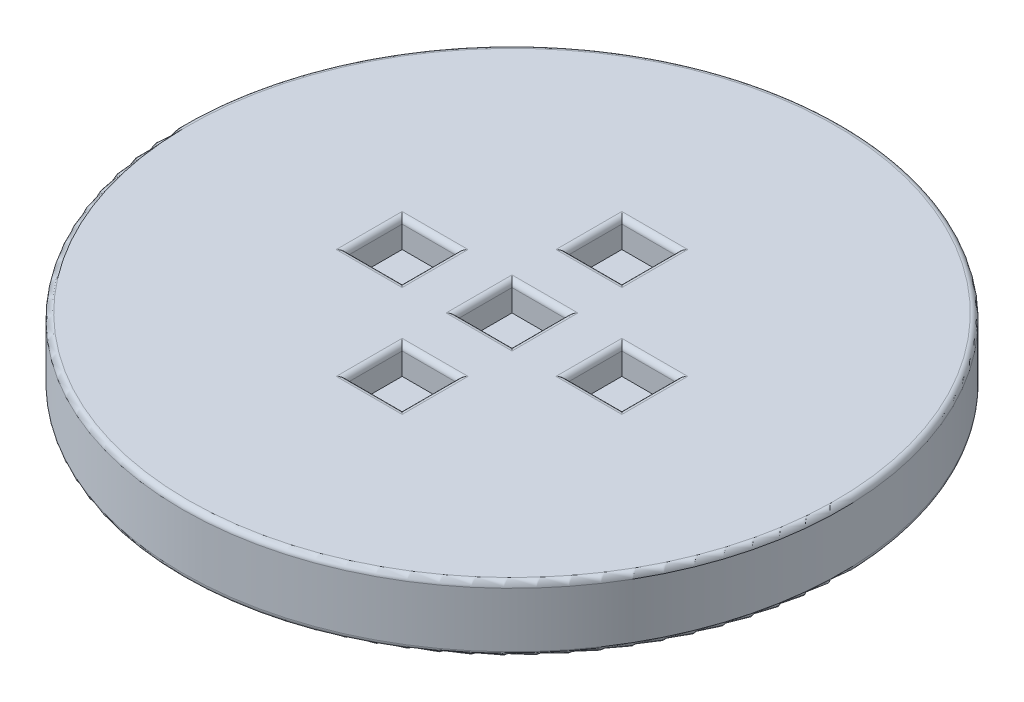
from build123d import *

# Parameters (mm, degrees)
SKETCH1_R           = 30
BOSS_EXTRUDE1_DEPTH = 6
SKETCH2_W           = 5
SKETCH2_H           = 5
CUT_EXTRUDE1_DEPTH  = 2.5
FILLET1_R           = 0.5
SKETCH4_W           = 5
SKETCH4_H           = 5
CUT_EXTRUDE2_DEPTH  = 2.5
FILLET2_R           = 0.5
FILLET3_R           = 0.5


with BuildPart() as part:
    # Sketch1 → Boss-Extrude1 (new body)
    with BuildSketch(Plane(origin=(0, 0, 0), x_dir=(1, 0, 0), z_dir=(0, 1, 0))):
        with Locations(Location((0, 0, 0), (0, 0, 270))):
            Circle(SKETCH1_R)
    extrude(amount=BOSS_EXTRUDE1_DEPTH)

    # Sketch2 → Cut-Extrude1 (cut)
    with BuildSketch(Plane(origin=(0, 6, 0), x_dir=(1, 0, 0), z_dir=(0, 1, 0))):
        with Locations((0, -10)):
            Rectangle(SKETCH2_W, SKETCH2_H)
        with Locations((-10, 0)):
            Rectangle(SKETCH2_W, SKETCH2_H)
        Rectangle(SKETCH2_W, SKETCH2_H)
        with Locations((0, 10)):
            Rectangle(SKETCH2_W, SKETCH2_H)
        with Locations((10, 0)):
            Rectangle(SKETCH2_W, SKETCH2_H)
    extrude(amount=-CUT_EXTRUDE1_DEPTH, mode=Mode.SUBTRACT)

    # Fillet1
    fillet1_edges = [part.edges().sort_by_distance(p)[0] for p in [
        (2.5, 6, 0),
        (0, 6, 2.5),
        (-12.5, 6, 0),
        (-10, 6, 2.5),
        (-7.5, 6, 0),
        (-10, 6, -2.5),
    ]]
    fillet(fillet1_edges, radius=FILLET1_R)

    # Sketch4 → Cut-Extrude2 (cut)
    with BuildSketch(Plane(origin=(0, 0, 0), x_dir=(-1, 0, 0), z_dir=(0, -1, 0))):
        Rectangle(SKETCH4_W, SKETCH4_H)
        with Locations((0, -10)):
            Rectangle(SKETCH4_W, SKETCH4_H)
        with Locations((10, 0)):
            Rectangle(SKETCH4_W, SKETCH4_H)
        with Locations((-10, 0)):
            Rectangle(SKETCH4_W, SKETCH4_H)
        with Locations((0, 10)):
            Rectangle(SKETCH4_W, SKETCH4_H)
    extrude(amount=-CUT_EXTRUDE2_DEPTH, mode=Mode.SUBTRACT)

    # Fillet2
    fillet2_edges = [part.edges().sort_by_distance(p)[0] for p in [
        (-2.5, 0, 0),
        (0, 0, -2.5),
        (2.5, 0, 0),
        (0, 0, 2.5),
        (-2.5, 0, 10),
        (0, 0, 7.5),
        (2.5, 0, 10),
        (0, 0, 12.5),
        (-12.5, 0, 0),
        (-10, 0, -2.5),
        (-7.5, 0, 0),
        (-10, 0, 2.5),
        (7.5, 0, 0),
        (10, 0, -2.5),
        (12.5, 0, 0),
        (10, 0, 2.5),
        (2.5, 0, -10),
        (0, 0, -7.5),
        (-2.5, 0, -10),
        (0, 0, -12.5),
        (0, 0, -30),
    ]]
    fillet(fillet2_edges, radius=FILLET2_R)

    # Fillet3
    fillet3_edges = [part.edges().sort_by_distance(p)[0] for p in [
        (0, 6, -30),
        (0, 6, 7.5),
        (-2.5, 6, 10),
        (0, 6, 12.5),
        (2.5, 6, 10),
        (-2.5, 6, 0.25),
        (0.25, 6, -2.5),
        (0, 6, -12.5),
        (-2.5, 6, -10),
        (0, 6, -7.5),
        (2.5, 6, -10),
        (10, 6, 2.5),
        (12.5, 6, 0),
        (10, 6, -2.5),
        (7.5, 6, 0),
    ]]
    fillet(fillet3_edges, radius=FILLET3_R)


solid = part.part
